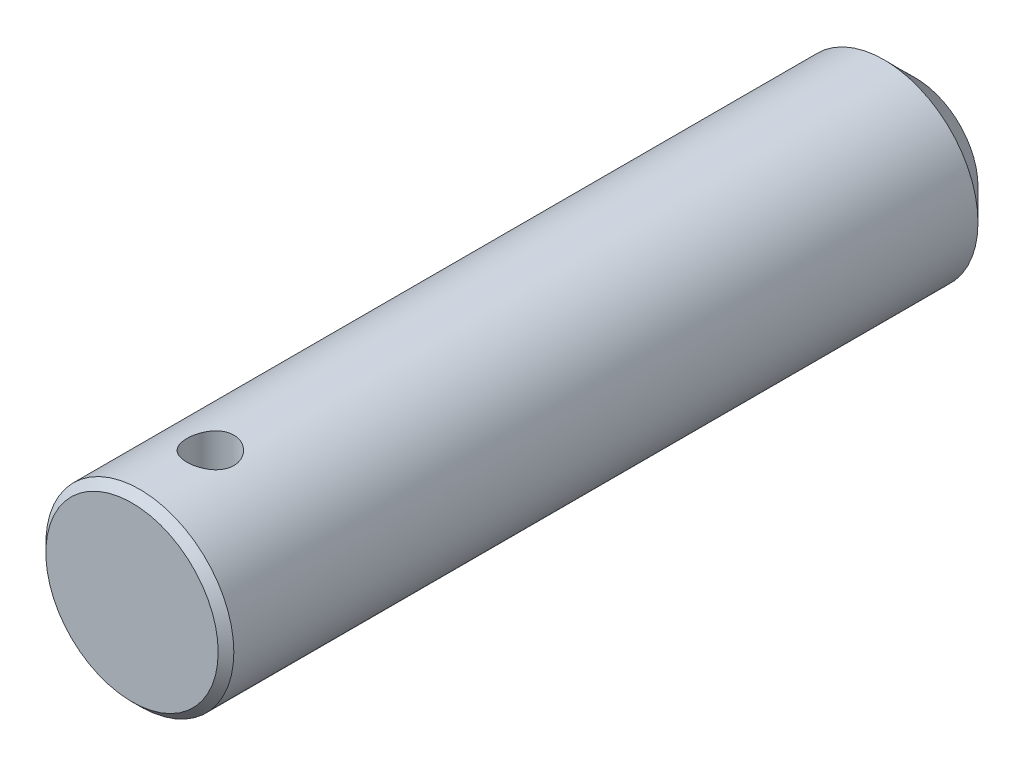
from build123d import *

# Parameters (mm, degrees)
ESQUISSE1_R             = 6
EXTRUSION1_DEPTH        = 50
CHANFREIN2_SIZE         = 2
ESQUISSE2_R             = 1.5
ENL_V_MAT_EXTRU_1_DEPTH = 10
CHANFREIN3_SIZE         = 0.5


with BuildPart() as part:
    # Esquisse1 → Extrusion1 (new body)
    with BuildSketch(Plane.XY):
        Circle(ESQUISSE1_R)
    extrude(amount=EXTRUSION1_DEPTH)

    # Chanfrein2
    chanfrein2_edges = [part.edges().sort_by_distance(p)[0] for p in [
        (-6, 0, 0),
    ]]
    chamfer(chanfrein2_edges, length=CHANFREIN2_SIZE)

    # Esquisse2 → Enl_v. mat.-Extru.1 (cut, symmetric)
    with BuildSketch(Plane(origin=(0, 0, 0), x_dir=(1, 0, 0), z_dir=(0, 1, 0))):
        with Locations(Location((0, -45, 0), (0, 0, 270))):
            Circle(ESQUISSE2_R)
    extrude(amount=ENL_V_MAT_EXTRU_1_DEPTH, both=True, mode=Mode.SUBTRACT)

    # Chanfrein3
    chanfrein3_edges = [part.edges().sort_by_distance(p)[0] for p in [
        (-6, 0, 50),
    ]]
    chamfer(chanfrein3_edges, length=CHANFREIN3_SIZE)


solid = part.part
